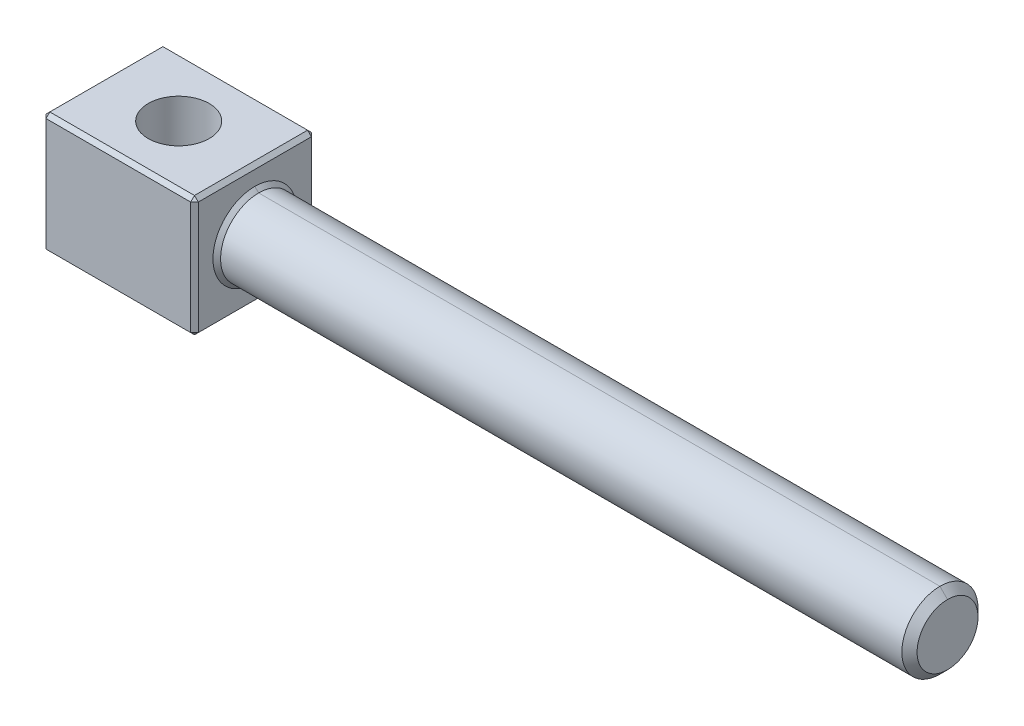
ISO-10303-21;
HEADER;
FILE_DESCRIPTION(('STEP AP214'),'2;1');
FILE_NAME('part.step','',(''),(''),'','','');
FILE_SCHEMA(('AUTOMOTIVE_DESIGN { 1 0 10303 214 1 1 1 1 }'));
ENDSEC;
DATA;
#1=APPLICATION_CONTEXT('core data for automotive mechanical design processes');
#2=APPLICATION_PROTOCOL_DEFINITION('international standard','automotive_design',2000,#1);
#3=PRODUCT_CONTEXT('',#1,'mechanical');
#4=PRODUCT('Part','Part','',(#3));
#5=PRODUCT_RELATED_PRODUCT_CATEGORY('part','',(#4));
#6=PRODUCT_DEFINITION_FORMATION('','',#4);
#7=PRODUCT_DEFINITION_CONTEXT('part definition',#1,'design');
#8=PRODUCT_DEFINITION('design','',#6,#7);
#9=PRODUCT_DEFINITION_SHAPE('','',#8);
#10=(LENGTH_UNIT() NAMED_UNIT(*) SI_UNIT(.MILLI.,.METRE.));
#11=(NAMED_UNIT(*) PLANE_ANGLE_UNIT() SI_UNIT($,.RADIAN.));
#12=(NAMED_UNIT(*) SI_UNIT($,.STERADIAN.) SOLID_ANGLE_UNIT());
#13=UNCERTAINTY_MEASURE_WITH_UNIT(LENGTH_MEASURE(1.E-05),#10,'distance_accuracy_value','');
#14=(GEOMETRIC_REPRESENTATION_CONTEXT(3) GLOBAL_UNCERTAINTY_ASSIGNED_CONTEXT((#13)) GLOBAL_UNIT_ASSIGNED_CONTEXT((#10,
#11,#12)) REPRESENTATION_CONTEXT('',''));
#15=CARTESIAN_POINT('',(0.,0.,0.));
#16=DIRECTION('',(0.,0.,1.));
#17=DIRECTION('',(1.,0.,0.));
#18=AXIS2_PLACEMENT_3D('',#15,#16,#17);
#19=CARTESIAN_POINT('',(10.5,0.,0.));
#20=DIRECTION('',(-1.,0.,0.));
#21=DIRECTION('',(0.,-1.,0.));
#22=AXIS2_PLACEMENT_3D('',#19,#20,#21);
#23=CONICAL_SURFACE('',#22,5.,0.785398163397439);
#24=CARTESIAN_POINT('',(10.5,0.,0.));
#25=DIRECTION('',(1.,0.,0.));
#26=DIRECTION('',(0.,1.,0.));
#27=AXIS2_PLACEMENT_3D('',#24,#25,#26);
#28=CIRCLE('',#27,5.);
#29=CARTESIAN_POINT('',(10.5,5.,0.));
#30=VERTEX_POINT('',#29);
#31=CARTESIAN_POINT('',(10.5,-5.,0.));
#32=VERTEX_POINT('',#31);
#33=EDGE_CURVE('E288',#30,#32,#28,.T.);
#34=ORIENTED_EDGE('',*,*,#33,.F.);
#35=DIRECTION('',(-0.707106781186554,0.707106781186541,0.));
#36=VECTOR('',#35,1.);
#37=CARTESIAN_POINT('',(10.5,5.,0.));
#38=LINE('',#37,#36);
#39=CARTESIAN_POINT('',(10.,5.5,0.));
#40=VERTEX_POINT('',#39);
#41=EDGE_CURVE('E9',#30,#40,#38,.T.);
#42=ORIENTED_EDGE('',*,*,#41,.T.);
#43=CARTESIAN_POINT('',(10.,0.,0.));
#44=DIRECTION('',(-1.,0.,0.));
#45=DIRECTION('',(0.,1.,0.));
#46=AXIS2_PLACEMENT_3D('',#43,#44,#45);
#47=CIRCLE('',#46,5.5);
#48=CARTESIAN_POINT('',(10.,-5.5,0.));
#49=VERTEX_POINT('',#48);
#50=EDGE_CURVE('E308',#49,#40,#47,.T.);
#51=ORIENTED_EDGE('',*,*,#50,.F.);
#52=DIRECTION('',(-0.707106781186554,-0.707106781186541,0.));
#53=VECTOR('',#52,1.);
#54=CARTESIAN_POINT('',(10.5,-5.,0.));
#55=LINE('',#54,#53);
#56=EDGE_CURVE('E246',#32,#49,#55,.T.);
#57=ORIENTED_EDGE('',*,*,#56,.F.);
#58=EDGE_LOOP('',(#34,#42,#51,#57));
#59=FACE_BOUND('',#58,.T.);
#60=ADVANCED_FACE('F14',(#59),#23,.T.);
#61=CARTESIAN_POINT('',(100.96,0.,0.));
#62=DIRECTION('',(-1.,0.,0.));
#63=DIRECTION('',(0.,-1.,0.));
#64=AXIS2_PLACEMENT_3D('',#61,#62,#63);
#65=CONICAL_SURFACE('',#64,4.,0.785398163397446);
#66=CARTESIAN_POINT('',(100.96,0.,0.));
#67=DIRECTION('',(1.,0.,0.));
#68=DIRECTION('',(0.,1.,0.));
#69=AXIS2_PLACEMENT_3D('',#66,#67,#68);
#70=CIRCLE('',#69,4.);
#71=CARTESIAN_POINT('',(100.96,4.,0.));
#72=VERTEX_POINT('',#71);
#73=CARTESIAN_POINT('',(100.96,-4.,0.));
#74=VERTEX_POINT('',#73);
#75=EDGE_CURVE('E272',#72,#74,#70,.T.);
#76=ORIENTED_EDGE('',*,*,#75,.F.);
#77=DIRECTION('',(-0.707106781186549,0.707106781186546,0.));
#78=VECTOR('',#77,1.);
#79=CARTESIAN_POINT('',(100.96,4.,0.));
#80=LINE('',#79,#78);
#81=CARTESIAN_POINT('',(99.96,5.,0.));
#82=VERTEX_POINT('',#81);
#83=EDGE_CURVE('E25',#72,#82,#80,.T.);
#84=ORIENTED_EDGE('',*,*,#83,.T.);
#85=CARTESIAN_POINT('',(99.96,0.,0.));
#86=DIRECTION('',(-1.,0.,0.));
#87=DIRECTION('',(0.,1.,0.));
#88=AXIS2_PLACEMENT_3D('',#85,#86,#87);
#89=CIRCLE('',#88,5.);
#90=CARTESIAN_POINT('',(99.96,-5.,0.));
#91=VERTEX_POINT('',#90);
#92=EDGE_CURVE('E239',#91,#82,#89,.T.);
#93=ORIENTED_EDGE('',*,*,#92,.F.);
#94=DIRECTION('',(-0.707106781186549,-0.707106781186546,0.));
#95=VECTOR('',#94,1.);
#96=CARTESIAN_POINT('',(100.96,-4.,0.));
#97=LINE('',#96,#95);
#98=EDGE_CURVE('E130',#74,#91,#97,.T.);
#99=ORIENTED_EDGE('',*,*,#98,.F.);
#100=EDGE_LOOP('',(#76,#84,#93,#99));
#101=FACE_BOUND('',#100,.T.);
#102=ADVANCED_FACE('F442',(#101),#65,.T.);
#103=CARTESIAN_POINT('',(100.96,0.,0.));
#104=DIRECTION('',(-1.,0.,0.));
#105=DIRECTION('',(0.,-1.,0.));
#106=AXIS2_PLACEMENT_3D('',#103,#104,#105);
#107=CYLINDRICAL_SURFACE('',#106,5.);
#108=ORIENTED_EDGE('',*,*,#92,.T.);
#109=DIRECTION('',(-1.,0.,0.));
#110=VECTOR('',#109,1.);
#111=CARTESIAN_POINT('',(100.96,5.,0.));
#112=LINE('',#111,#110);
#113=EDGE_CURVE('E225',#82,#30,#112,.T.);
#114=ORIENTED_EDGE('',*,*,#113,.T.);
#115=ORIENTED_EDGE('',*,*,#33,.T.);
#116=DIRECTION('',(-1.,0.,0.));
#117=VECTOR('',#116,1.);
#118=CARTESIAN_POINT('',(100.96,-5.,0.));
#119=LINE('',#118,#117);
#120=EDGE_CURVE('E318',#91,#32,#119,.T.);
#121=ORIENTED_EDGE('',*,*,#120,.F.);
#122=EDGE_LOOP('',(#108,#114,#115,#121));
#123=FACE_BOUND('',#122,.T.);
#124=ADVANCED_FACE('F429',(#123),#107,.T.);
#125=CARTESIAN_POINT('',(10.,-7.925,7.925));
#126=DIRECTION('',(0.,1.,0.));
#127=DIRECTION('',(-1.,0.,0.));
#128=AXIS2_PLACEMENT_3D('',#125,#126,#127);
#129=PLANE('',#128);
#130=DIRECTION('',(1.,0.,0.));
#131=VECTOR('',#130,1.);
#132=CARTESIAN_POINT('',(10.,-7.925,-7.425));
#133=LINE('',#132,#131);
#134=CARTESIAN_POINT('',(-9.5,-7.925,-7.425));
#135=VERTEX_POINT('',#134);
#136=CARTESIAN_POINT('',(9.5,-7.925,-7.425));
#137=VERTEX_POINT('',#136);
#138=EDGE_CURVE('E292',#135,#137,#133,.T.);
#139=ORIENTED_EDGE('',*,*,#138,.T.);
#140=DIRECTION('',(0.,0.,1.));
#141=VECTOR('',#140,1.);
#142=CARTESIAN_POINT('',(9.5,-7.925,7.925));
#143=LINE('',#142,#141);
#144=CARTESIAN_POINT('',(9.5,-7.925,7.425));
#145=VERTEX_POINT('',#144);
#146=EDGE_CURVE('E375',#137,#145,#143,.T.);
#147=ORIENTED_EDGE('',*,*,#146,.T.);
#148=DIRECTION('',(-1.,0.,0.));
#149=VECTOR('',#148,1.);
#150=CARTESIAN_POINT('',(10.,-7.925,7.425));
#151=LINE('',#150,#149);
#152=CARTESIAN_POINT('',(-9.5,-7.925,7.425));
#153=VERTEX_POINT('',#152);
#154=EDGE_CURVE('E295',#145,#153,#151,.T.);
#155=ORIENTED_EDGE('',*,*,#154,.T.);
#156=DIRECTION('',(0.,0.,-1.));
#157=VECTOR('',#156,1.);
#158=CARTESIAN_POINT('',(-9.5,-7.925,7.925));
#159=LINE('',#158,#157);
#160=EDGE_CURVE('E266',#153,#135,#159,.T.);
#161=ORIENTED_EDGE('',*,*,#160,.T.);
#162=EDGE_LOOP('',(#139,#147,#155,#161));
#163=FACE_BOUND('',#162,.T.);
#164=CARTESIAN_POINT('',(0.,-7.925,0.));
#165=DIRECTION('',(0.,-1.,0.));
#166=DIRECTION('',(1.,0.,0.));
#167=AXIS2_PLACEMENT_3D('',#164,#165,#166);
#168=CIRCLE('',#167,4.);
#169=CARTESIAN_POINT('',(4.,-7.925,0.));
#170=VERTEX_POINT('',#169);
#171=EDGE_CURVE('E595',#170,#170,#168,.T.);
#172=ORIENTED_EDGE('',*,*,#171,.F.);
#173=EDGE_LOOP('',(#172));
#174=FACE_BOUND('',#173,.T.);
#175=ADVANCED_FACE('F538',(#163,#174),#129,.F.);
#176=CARTESIAN_POINT('',(10.,-7.925,-7.925));
#177=DIRECTION('',(0.,0.,1.));
#178=DIRECTION('',(1.,0.,0.));
#179=AXIS2_PLACEMENT_3D('',#176,#177,#178);
#180=PLANE('',#179);
#181=DIRECTION('',(0.,1.,0.));
#182=VECTOR('',#181,1.);
#183=CARTESIAN_POINT('',(-9.5,-7.925,-7.925));
#184=LINE('',#183,#182);
#185=CARTESIAN_POINT('',(-9.5,-7.425,-7.925));
#186=VERTEX_POINT('',#185);
#187=CARTESIAN_POINT('',(-9.5,7.425,-7.925));
#188=VERTEX_POINT('',#187);
#189=EDGE_CURVE('E210',#186,#188,#184,.T.);
#190=ORIENTED_EDGE('',*,*,#189,.T.);
#191=DIRECTION('',(1.,0.,0.));
#192=VECTOR('',#191,1.);
#193=CARTESIAN_POINT('',(10.,7.425,-7.925));
#194=LINE('',#193,#192);
#195=CARTESIAN_POINT('',(9.5,7.425,-7.925));
#196=VERTEX_POINT('',#195);
#197=EDGE_CURVE('E267',#188,#196,#194,.T.);
#198=ORIENTED_EDGE('',*,*,#197,.T.);
#199=DIRECTION('',(0.,-1.,0.));
#200=VECTOR('',#199,1.);
#201=CARTESIAN_POINT('',(9.5,-7.925,-7.925));
#202=LINE('',#201,#200);
#203=CARTESIAN_POINT('',(9.5,-7.425,-7.925));
#204=VERTEX_POINT('',#203);
#205=EDGE_CURVE('E271',#196,#204,#202,.T.);
#206=ORIENTED_EDGE('',*,*,#205,.T.);
#207=DIRECTION('',(-1.,0.,0.));
#208=VECTOR('',#207,1.);
#209=CARTESIAN_POINT('',(10.,-7.425,-7.925));
#210=LINE('',#209,#208);
#211=EDGE_CURVE('E335',#204,#186,#210,.T.);
#212=ORIENTED_EDGE('',*,*,#211,.T.);
#213=EDGE_LOOP('',(#190,#198,#206,#212));
#214=FACE_BOUND('',#213,.T.);
#215=ADVANCED_FACE('F16',(#214),#180,.F.);
#216=CARTESIAN_POINT('',(10.,7.925,7.925));
#217=DIRECTION('',(0.,-1.,0.));
#218=DIRECTION('',(1.,0.,0.));
#219=AXIS2_PLACEMENT_3D('',#216,#217,#218);
#220=PLANE('',#219);
#221=DIRECTION('',(-1.,0.,0.));
#222=VECTOR('',#221,1.);
#223=CARTESIAN_POINT('',(10.,7.925,-7.425));
#224=LINE('',#223,#222);
#225=CARTESIAN_POINT('',(9.5,7.925,-7.425));
#226=VERTEX_POINT('',#225);
#227=CARTESIAN_POINT('',(-9.5,7.925,-7.425));
#228=VERTEX_POINT('',#227);
#229=EDGE_CURVE('E230',#226,#228,#224,.T.);
#230=ORIENTED_EDGE('',*,*,#229,.T.);
#231=DIRECTION('',(0.,0.,1.));
#232=VECTOR('',#231,1.);
#233=CARTESIAN_POINT('',(-9.5,7.925,7.925));
#234=LINE('',#233,#232);
#235=CARTESIAN_POINT('',(-9.5,7.925,7.425));
#236=VERTEX_POINT('',#235);
#237=EDGE_CURVE('E227',#228,#236,#234,.T.);
#238=ORIENTED_EDGE('',*,*,#237,.T.);
#239=DIRECTION('',(1.,0.,0.));
#240=VECTOR('',#239,1.);
#241=CARTESIAN_POINT('',(10.,7.925,7.425));
#242=LINE('',#241,#240);
#243=CARTESIAN_POINT('',(9.5,7.925,7.425));
#244=VERTEX_POINT('',#243);
#245=EDGE_CURVE('E231',#236,#244,#242,.T.);
#246=ORIENTED_EDGE('',*,*,#245,.T.);
#247=DIRECTION('',(0.,0.,-1.));
#248=VECTOR('',#247,1.);
#249=CARTESIAN_POINT('',(9.5,7.925,-7.925));
#250=LINE('',#249,#248);
#251=EDGE_CURVE('E296',#244,#226,#250,.T.);
#252=ORIENTED_EDGE('',*,*,#251,.T.);
#253=EDGE_LOOP('',(#230,#238,#246,#252));
#254=FACE_BOUND('',#253,.T.);
#255=CARTESIAN_POINT('',(0.,7.925,0.));
#256=DIRECTION('',(0.,-1.,0.));
#257=DIRECTION('',(0.,0.,-1.));
#258=AXIS2_PLACEMENT_3D('',#255,#256,#257);
#259=CIRCLE('',#258,4.);
#260=CARTESIAN_POINT('',(0.,7.925,-4.));
#261=VERTEX_POINT('',#260);
#262=EDGE_CURVE('E383',#261,#261,#259,.F.);
#263=ORIENTED_EDGE('',*,*,#262,.F.);
#264=EDGE_LOOP('',(#263));
#265=FACE_BOUND('',#264,.T.);
#266=ADVANCED_FACE('F505',(#254,#265),#220,.F.);
#267=CARTESIAN_POINT('',(10.,-7.925,7.925));
#268=DIRECTION('',(0.,0.,-1.));
#269=DIRECTION('',(0.,1.,0.));
#270=AXIS2_PLACEMENT_3D('',#267,#268,#269);
#271=PLANE('',#270);
#272=DIRECTION('',(0.,1.,0.));
#273=VECTOR('',#272,1.);
#274=CARTESIAN_POINT('',(9.5,7.925,7.925));
#275=LINE('',#274,#273);
#276=CARTESIAN_POINT('',(9.5,-7.425,7.925));
#277=VERTEX_POINT('',#276);
#278=CARTESIAN_POINT('',(9.5,7.425,7.925));
#279=VERTEX_POINT('',#278);
#280=EDGE_CURVE('E300',#277,#279,#275,.T.);
#281=ORIENTED_EDGE('',*,*,#280,.T.);
#282=DIRECTION('',(-1.,0.,0.));
#283=VECTOR('',#282,1.);
#284=CARTESIAN_POINT('',(10.,7.425,7.925));
#285=LINE('',#284,#283);
#286=CARTESIAN_POINT('',(-9.5,7.425,7.925));
#287=VERTEX_POINT('',#286);
#288=EDGE_CURVE('E255',#279,#287,#285,.T.);
#289=ORIENTED_EDGE('',*,*,#288,.T.);
#290=DIRECTION('',(0.,-1.,0.));
#291=VECTOR('',#290,1.);
#292=CARTESIAN_POINT('',(-9.5,-7.925,7.925));
#293=LINE('',#292,#291);
#294=CARTESIAN_POINT('',(-9.5,-7.425,7.925));
#295=VERTEX_POINT('',#294);
#296=EDGE_CURVE('E251',#287,#295,#293,.T.);
#297=ORIENTED_EDGE('',*,*,#296,.T.);
#298=DIRECTION('',(1.,0.,0.));
#299=VECTOR('',#298,1.);
#300=CARTESIAN_POINT('',(10.,-7.425,7.925));
#301=LINE('',#300,#299);
#302=EDGE_CURVE('E256',#295,#277,#301,.T.);
#303=ORIENTED_EDGE('',*,*,#302,.T.);
#304=EDGE_LOOP('',(#281,#289,#297,#303));
#305=FACE_BOUND('',#304,.T.);
#306=ADVANCED_FACE('F491',(#305),#271,.F.);
#307=CARTESIAN_POINT('',(10.,-0.849528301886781,0.494811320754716));
#308=DIRECTION('',(1.,0.,0.));
#309=DIRECTION('',(0.,0.,1.));
#310=AXIS2_PLACEMENT_3D('',#307,#308,#309);
#311=PLANE('',#310);
#312=DIRECTION('',(0.,1.,0.));
#313=VECTOR('',#312,1.);
#314=CARTESIAN_POINT('',(10.,7.925,-7.425));
#315=LINE('',#314,#313);
#316=CARTESIAN_POINT('',(10.,-7.425,-7.425));
#317=VERTEX_POINT('',#316);
#318=CARTESIAN_POINT('',(10.,7.425,-7.425));
#319=VERTEX_POINT('',#318);
#320=EDGE_CURVE('E283',#317,#319,#315,.T.);
#321=ORIENTED_EDGE('',*,*,#320,.T.);
#322=DIRECTION('',(0.,0.,1.));
#323=VECTOR('',#322,1.);
#324=CARTESIAN_POINT('',(10.,7.425,7.925));
#325=LINE('',#324,#323);
#326=CARTESIAN_POINT('',(10.,7.425,7.425));
#327=VERTEX_POINT('',#326);
#328=EDGE_CURVE('E279',#319,#327,#325,.T.);
#329=ORIENTED_EDGE('',*,*,#328,.T.);
#330=DIRECTION('',(0.,-1.,0.));
#331=VECTOR('',#330,1.);
#332=CARTESIAN_POINT('',(10.,-7.925,7.425));
#333=LINE('',#332,#331);
#334=CARTESIAN_POINT('',(10.,-7.425,7.425));
#335=VERTEX_POINT('',#334);
#336=EDGE_CURVE('E284',#327,#335,#333,.T.);
#337=ORIENTED_EDGE('',*,*,#336,.T.);
#338=DIRECTION('',(0.,0.,-1.));
#339=VECTOR('',#338,1.);
#340=CARTESIAN_POINT('',(10.,-7.425,-7.925));
#341=LINE('',#340,#339);
#342=EDGE_CURVE('E312',#335,#317,#341,.T.);
#343=ORIENTED_EDGE('',*,*,#342,.T.);
#344=EDGE_LOOP('',(#321,#329,#337,#343));
#345=FACE_BOUND('',#344,.T.);
#346=ORIENTED_EDGE('',*,*,#50,.T.);
#347=CARTESIAN_POINT('',(10.,0.,0.));
#348=DIRECTION('',(-1.,0.,0.));
#349=DIRECTION('',(0.,1.,0.));
#350=AXIS2_PLACEMENT_3D('',#347,#348,#349);
#351=CIRCLE('',#350,5.5);
#352=EDGE_CURVE('E313',#40,#49,#351,.T.);
#353=ORIENTED_EDGE('',*,*,#352,.T.);
#354=EDGE_LOOP('',(#346,#353));
#355=FACE_BOUND('',#354,.T.);
#356=ADVANCED_FACE('F542',(#345,#355),#311,.T.);
#357=CARTESIAN_POINT('',(-10.,-0.849528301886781,0.494811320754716));
#358=DIRECTION('',(1.,0.,0.));
#359=DIRECTION('',(0.,0.,1.));
#360=AXIS2_PLACEMENT_3D('',#357,#358,#359);
#361=PLANE('',#360);
#362=DIRECTION('',(0.,1.,0.));
#363=VECTOR('',#362,1.);
#364=CARTESIAN_POINT('',(-10.,-0.849528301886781,7.425));
#365=LINE('',#364,#363);
#366=CARTESIAN_POINT('',(-10.,-7.425,7.425));
#367=VERTEX_POINT('',#366);
#368=CARTESIAN_POINT('',(-10.,7.425,7.425));
#369=VERTEX_POINT('',#368);
#370=EDGE_CURVE('E356',#367,#369,#365,.T.);
#371=ORIENTED_EDGE('',*,*,#370,.T.);
#372=DIRECTION('',(0.,0.,-1.));
#373=VECTOR('',#372,1.);
#374=CARTESIAN_POINT('',(-10.,7.425,0.494811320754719));
#375=LINE('',#374,#373);
#376=CARTESIAN_POINT('',(-10.,7.425,-7.425));
#377=VERTEX_POINT('',#376);
#378=EDGE_CURVE('E201',#369,#377,#375,.T.);
#379=ORIENTED_EDGE('',*,*,#378,.T.);
#380=DIRECTION('',(0.,-1.,0.));
#381=VECTOR('',#380,1.);
#382=CARTESIAN_POINT('',(-10.,-0.849528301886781,-7.425));
#383=LINE('',#382,#381);
#384=CARTESIAN_POINT('',(-10.,-7.425,-7.425));
#385=VERTEX_POINT('',#384);
#386=EDGE_CURVE('E195',#377,#385,#383,.T.);
#387=ORIENTED_EDGE('',*,*,#386,.T.);
#388=DIRECTION('',(0.,0.,1.));
#389=VECTOR('',#388,1.);
#390=CARTESIAN_POINT('',(-10.,-7.425,0.494811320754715));
#391=LINE('',#390,#389);
#392=EDGE_CURVE('E18',#385,#367,#391,.T.);
#393=ORIENTED_EDGE('',*,*,#392,.T.);
#394=EDGE_LOOP('',(#371,#379,#387,#393));
#395=FACE_BOUND('',#394,.T.);
#396=ADVANCED_FACE('F199',(#395),#361,.F.);
#397=CARTESIAN_POINT('',(100.96,0.,0.));
#398=DIRECTION('',(-1.,0.,0.));
#399=DIRECTION('',(0.,-1.,0.));
#400=AXIS2_PLACEMENT_3D('',#397,#398,#399);
#401=CYLINDRICAL_SURFACE('',#400,5.);
#402=ORIENTED_EDGE('',*,*,#113,.F.);
#403=CARTESIAN_POINT('',(99.96,0.,0.));
#404=DIRECTION('',(-1.,0.,0.));
#405=DIRECTION('',(0.,1.,0.));
#406=AXIS2_PLACEMENT_3D('',#403,#404,#405);
#407=CIRCLE('',#406,5.);
#408=EDGE_CURVE('E196',#82,#91,#407,.T.);
#409=ORIENTED_EDGE('',*,*,#408,.T.);
#410=ORIENTED_EDGE('',*,*,#120,.T.);
#411=CARTESIAN_POINT('',(10.5,0.,0.));
#412=DIRECTION('',(1.,0.,0.));
#413=DIRECTION('',(0.,1.,0.));
#414=AXIS2_PLACEMENT_3D('',#411,#412,#413);
#415=CIRCLE('',#414,5.);
#416=EDGE_CURVE('E307',#32,#30,#415,.T.);
#417=ORIENTED_EDGE('',*,*,#416,.T.);
#418=EDGE_LOOP('',(#402,#409,#410,#417));
#419=FACE_BOUND('',#418,.T.);
#420=ADVANCED_FACE('F437',(#419),#401,.T.);
#421=CARTESIAN_POINT('',(100.96,0.,0.));
#422=DIRECTION('',(1.,0.,0.));
#423=DIRECTION('',(0.,0.,1.));
#424=AXIS2_PLACEMENT_3D('',#421,#422,#423);
#425=PLANE('',#424);
#426=CARTESIAN_POINT('',(100.96,0.,0.));
#427=DIRECTION('',(1.,0.,0.));
#428=DIRECTION('',(0.,1.,0.));
#429=AXIS2_PLACEMENT_3D('',#426,#427,#428);
#430=CIRCLE('',#429,4.);
#431=EDGE_CURVE('E275',#74,#72,#430,.T.);
#432=ORIENTED_EDGE('',*,*,#431,.T.);
#433=ORIENTED_EDGE('',*,*,#75,.T.);
#434=EDGE_LOOP('',(#432,#433));
#435=FACE_BOUND('',#434,.T.);
#436=ADVANCED_FACE('F446',(#435),#425,.T.);
#437=CARTESIAN_POINT('',(100.96,0.,0.));
#438=DIRECTION('',(-1.,0.,0.));
#439=DIRECTION('',(0.,-1.,0.));
#440=AXIS2_PLACEMENT_3D('',#437,#438,#439);
#441=CONICAL_SURFACE('',#440,4.,0.785398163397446);
#442=ORIENTED_EDGE('',*,*,#83,.F.);
#443=ORIENTED_EDGE('',*,*,#431,.F.);
#444=ORIENTED_EDGE('',*,*,#98,.T.);
#445=ORIENTED_EDGE('',*,*,#408,.F.);
#446=EDGE_LOOP('',(#442,#443,#444,#445));
#447=FACE_BOUND('',#446,.T.);
#448=ADVANCED_FACE('F444',(#447),#441,.T.);
#449=CARTESIAN_POINT('',(10.5,0.,0.));
#450=DIRECTION('',(-1.,0.,0.));
#451=DIRECTION('',(0.,-1.,0.));
#452=AXIS2_PLACEMENT_3D('',#449,#450,#451);
#453=CONICAL_SURFACE('',#452,5.,0.785398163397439);
#454=ORIENTED_EDGE('',*,*,#41,.F.);
#455=ORIENTED_EDGE('',*,*,#416,.F.);
#456=ORIENTED_EDGE('',*,*,#56,.T.);
#457=ORIENTED_EDGE('',*,*,#352,.F.);
#458=EDGE_LOOP('',(#454,#455,#456,#457));
#459=FACE_BOUND('',#458,.T.);
#460=ADVANCED_FACE('F434',(#459),#453,.T.);
#461=CARTESIAN_POINT('',(10.,-7.425,0.494811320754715));
#462=DIRECTION('',(0.707106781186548,-0.707106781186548,0.));
#463=DIRECTION('',(0.,0.,-1.));
#464=AXIS2_PLACEMENT_3D('',#461,#462,#463);
#465=PLANE('',#464);
#466=DIRECTION('',(-0.707106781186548,-0.707106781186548,0.));
#467=VECTOR('',#466,1.);
#468=CARTESIAN_POINT('',(9.75,-7.675,-7.425));
#469=LINE('',#468,#467);
#470=EDGE_CURVE('E250',#317,#137,#469,.T.);
#471=ORIENTED_EDGE('',*,*,#470,.F.);
#472=ORIENTED_EDGE('',*,*,#342,.F.);
#473=DIRECTION('',(0.707106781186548,0.707106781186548,0.));
#474=VECTOR('',#473,1.);
#475=CARTESIAN_POINT('',(9.5,-7.925,7.425));
#476=LINE('',#475,#474);
#477=EDGE_CURVE('E278',#145,#335,#476,.T.);
#478=ORIENTED_EDGE('',*,*,#477,.F.);
#479=ORIENTED_EDGE('',*,*,#146,.F.);
#480=EDGE_LOOP('',(#471,#472,#478,#479));
#481=FACE_BOUND('',#480,.T.);
#482=ADVANCED_FACE('F454',(#481),#465,.T.);
#483=CARTESIAN_POINT('',(9.5,-7.425,-7.925));
#484=DIRECTION('',(0.577350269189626,-0.577350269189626,-0.577350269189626));
#485=DIRECTION('',(0.,0.707106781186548,-0.707106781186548));
#486=AXIS2_PLACEMENT_3D('',#483,#484,#485);
#487=PLANE('',#486);
#488=DIRECTION('',(-0.707106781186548,0.,-0.707106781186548));
#489=VECTOR('',#488,1.);
#490=CARTESIAN_POINT('',(9.5,-7.425,-7.925));
#491=LINE('',#490,#489);
#492=EDGE_CURVE('E232',#317,#204,#491,.T.);
#493=ORIENTED_EDGE('',*,*,#492,.F.);
#494=ORIENTED_EDGE('',*,*,#470,.T.);
#495=DIRECTION('',(0.,-0.707106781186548,0.707106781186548));
#496=VECTOR('',#495,1.);
#497=CARTESIAN_POINT('',(9.5,-7.425,-7.925));
#498=LINE('',#497,#496);
#499=EDGE_CURVE('E234',#204,#137,#498,.T.);
#500=ORIENTED_EDGE('',*,*,#499,.F.);
#501=EDGE_LOOP('',(#493,#494,#500));
#502=FACE_BOUND('',#501,.T.);
#503=ADVANCED_FACE('F473',(#502),#487,.T.);
#504=CARTESIAN_POINT('',(9.5,-7.925,7.425));
#505=DIRECTION('',(0.577350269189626,-0.577350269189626,0.577350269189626));
#506=DIRECTION('',(0.,0.707106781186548,0.707106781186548));
#507=AXIS2_PLACEMENT_3D('',#504,#505,#506);
#508=PLANE('',#507);
#509=DIRECTION('',(0.,0.707106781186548,0.707106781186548));
#510=VECTOR('',#509,1.);
#511=CARTESIAN_POINT('',(9.5,-7.925,7.425));
#512=LINE('',#511,#510);
#513=EDGE_CURVE('E349',#145,#277,#512,.T.);
#514=ORIENTED_EDGE('',*,*,#513,.F.);
#515=ORIENTED_EDGE('',*,*,#477,.T.);
#516=DIRECTION('',(0.707106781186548,0.,-0.707106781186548));
#517=VECTOR('',#516,1.);
#518=CARTESIAN_POINT('',(9.75,-7.425,7.675));
#519=LINE('',#518,#517);
#520=EDGE_CURVE('E235',#277,#335,#519,.T.);
#521=ORIENTED_EDGE('',*,*,#520,.F.);
#522=EDGE_LOOP('',(#514,#515,#521));
#523=FACE_BOUND('',#522,.T.);
#524=ADVANCED_FACE('F470',(#523),#508,.T.);
#525=CARTESIAN_POINT('',(10.,-7.425,-7.925));
#526=DIRECTION('',(0.,0.707106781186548,0.707106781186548));
#527=DIRECTION('',(-1.,0.,0.));
#528=AXIS2_PLACEMENT_3D('',#525,#526,#527);
#529=PLANE('',#528);
#530=ORIENTED_EDGE('',*,*,#499,.T.);
#531=ORIENTED_EDGE('',*,*,#138,.F.);
#532=DIRECTION('',(0.,-0.707106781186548,0.707106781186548));
#533=VECTOR('',#532,1.);
#534=CARTESIAN_POINT('',(-9.5,-7.675,-7.675));
#535=LINE('',#534,#533);
#536=EDGE_CURVE('E180',#186,#135,#535,.T.);
#537=ORIENTED_EDGE('',*,*,#536,.F.);
#538=ORIENTED_EDGE('',*,*,#211,.F.);
#539=EDGE_LOOP('',(#530,#531,#537,#538));
#540=FACE_BOUND('',#539,.T.);
#541=ADVANCED_FACE('F472',(#540),#529,.F.);
#542=CARTESIAN_POINT('',(10.,-0.849528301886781,-7.425));
#543=DIRECTION('',(0.707106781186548,0.,-0.707106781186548));
#544=DIRECTION('',(0.,1.,0.));
#545=AXIS2_PLACEMENT_3D('',#542,#543,#544);
#546=PLANE('',#545);
#547=ORIENTED_EDGE('',*,*,#492,.T.);
#548=ORIENTED_EDGE('',*,*,#205,.F.);
#549=DIRECTION('',(-0.707106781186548,0.,-0.707106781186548));
#550=VECTOR('',#549,1.);
#551=CARTESIAN_POINT('',(9.5,7.425,-7.925));
#552=LINE('',#551,#550);
#553=EDGE_CURVE('E342',#319,#196,#552,.T.);
#554=ORIENTED_EDGE('',*,*,#553,.F.);
#555=ORIENTED_EDGE('',*,*,#320,.F.);
#556=EDGE_LOOP('',(#547,#548,#554,#555));
#557=FACE_BOUND('',#556,.T.);
#558=ADVANCED_FACE('F480',(#557),#546,.T.);
#559=CARTESIAN_POINT('',(10.,7.425,0.494811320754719));
#560=DIRECTION('',(0.707106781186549,0.707106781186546,0.));
#561=DIRECTION('',(0.,0.,-1.));
#562=AXIS2_PLACEMENT_3D('',#559,#560,#561);
#563=PLANE('',#562);
#564=DIRECTION('',(-0.707106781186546,0.707106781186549,0.));
#565=VECTOR('',#564,1.);
#566=CARTESIAN_POINT('',(10.,7.425,7.425));
#567=LINE('',#566,#565);
#568=EDGE_CURVE('E379',#327,#244,#567,.T.);
#569=ORIENTED_EDGE('',*,*,#568,.F.);
#570=ORIENTED_EDGE('',*,*,#328,.F.);
#571=DIRECTION('',(0.707106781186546,-0.707106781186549,0.));
#572=VECTOR('',#571,1.);
#573=CARTESIAN_POINT('',(9.75,7.675,-7.425));
#574=LINE('',#573,#572);
#575=EDGE_CURVE('E185',#226,#319,#574,.T.);
#576=ORIENTED_EDGE('',*,*,#575,.F.);
#577=ORIENTED_EDGE('',*,*,#251,.F.);
#578=EDGE_LOOP('',(#569,#570,#576,#577));
#579=FACE_BOUND('',#578,.T.);
#580=ADVANCED_FACE('F502',(#579),#563,.T.);
#581=CARTESIAN_POINT('',(10.,-0.849528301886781,7.425));
#582=DIRECTION('',(0.707106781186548,0.,0.707106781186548));
#583=DIRECTION('',(0.,1.,0.));
#584=AXIS2_PLACEMENT_3D('',#581,#582,#583);
#585=PLANE('',#584);
#586=ORIENTED_EDGE('',*,*,#520,.T.);
#587=ORIENTED_EDGE('',*,*,#336,.F.);
#588=DIRECTION('',(0.707106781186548,0.,-0.707106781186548));
#589=VECTOR('',#588,1.);
#590=CARTESIAN_POINT('',(10.,7.425,7.425));
#591=LINE('',#590,#589);
#592=EDGE_CURVE('E369',#279,#327,#591,.T.);
#593=ORIENTED_EDGE('',*,*,#592,.F.);
#594=ORIENTED_EDGE('',*,*,#280,.F.);
#595=EDGE_LOOP('',(#586,#587,#593,#594));
#596=FACE_BOUND('',#595,.T.);
#597=ADVANCED_FACE('F493',(#596),#585,.T.);
#598=CARTESIAN_POINT('',(10.,-7.925,7.425));
#599=DIRECTION('',(0.,0.707106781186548,-0.707106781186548));
#600=DIRECTION('',(0.,-0.707106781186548,-0.707106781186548));
#601=AXIS2_PLACEMENT_3D('',#598,#599,#600);
#602=PLANE('',#601);
#603=ORIENTED_EDGE('',*,*,#513,.T.);
#604=ORIENTED_EDGE('',*,*,#302,.F.);
#605=DIRECTION('',(0.,0.707106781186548,0.707106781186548));
#606=VECTOR('',#605,1.);
#607=CARTESIAN_POINT('',(-9.5,-7.675,7.675));
#608=LINE('',#607,#606);
#609=EDGE_CURVE('E73',#153,#295,#608,.T.);
#610=ORIENTED_EDGE('',*,*,#609,.F.);
#611=ORIENTED_EDGE('',*,*,#154,.F.);
#612=EDGE_LOOP('',(#603,#604,#610,#611));
#613=FACE_BOUND('',#612,.T.);
#614=ADVANCED_FACE('F469',(#613),#602,.F.);
#615=CARTESIAN_POINT('',(-9.5,-7.925,7.925));
#616=DIRECTION('',(0.707106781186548,0.707106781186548,0.));
#617=DIRECTION('',(0.,0.,-1.));
#618=AXIS2_PLACEMENT_3D('',#615,#616,#617);
#619=PLANE('',#618);
#620=DIRECTION('',(-0.707106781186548,0.707106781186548,0.));
#621=VECTOR('',#620,1.);
#622=CARTESIAN_POINT('',(-10.,-7.425,-7.425));
#623=LINE('',#622,#621);
#624=EDGE_CURVE('E174',#135,#385,#623,.T.);
#625=ORIENTED_EDGE('',*,*,#624,.F.);
#626=ORIENTED_EDGE('',*,*,#160,.F.);
#627=DIRECTION('',(0.707106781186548,-0.707106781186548,0.));
#628=VECTOR('',#627,1.);
#629=CARTESIAN_POINT('',(-10.,-7.425,7.425));
#630=LINE('',#629,#628);
#631=EDGE_CURVE('E190',#367,#153,#630,.T.);
#632=ORIENTED_EDGE('',*,*,#631,.F.);
#633=ORIENTED_EDGE('',*,*,#392,.F.);
#634=EDGE_LOOP('',(#625,#626,#632,#633));
#635=FACE_BOUND('',#634,.T.);
#636=ADVANCED_FACE('F189',(#635),#619,.F.);
#637=CARTESIAN_POINT('',(-10.,-7.425,-7.425));
#638=DIRECTION('',(-0.577350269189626,-0.577350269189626,-0.577350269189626));
#639=DIRECTION('',(-0.707106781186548,0.,0.707106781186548));
#640=AXIS2_PLACEMENT_3D('',#637,#638,#639);
#641=PLANE('',#640);
#642=ORIENTED_EDGE('',*,*,#536,.T.);
#643=ORIENTED_EDGE('',*,*,#624,.T.);
#644=DIRECTION('',(-0.707106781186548,0.,0.707106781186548));
#645=VECTOR('',#644,1.);
#646=CARTESIAN_POINT('',(-10.,-7.425,-7.425));
#647=LINE('',#646,#645);
#648=EDGE_CURVE('E178',#186,#385,#647,.T.);
#649=ORIENTED_EDGE('',*,*,#648,.F.);
#650=EDGE_LOOP('',(#642,#643,#649));
#651=FACE_BOUND('',#650,.T.);
#652=ADVANCED_FACE('F176',(#651),#641,.T.);
#653=CARTESIAN_POINT('',(9.5,7.425,-7.925));
#654=DIRECTION('',(0.577350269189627,0.577350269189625,-0.577350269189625));
#655=DIRECTION('',(0.,-0.707106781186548,-0.707106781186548));
#656=AXIS2_PLACEMENT_3D('',#653,#654,#655);
#657=PLANE('',#656);
#658=ORIENTED_EDGE('',*,*,#575,.T.);
#659=ORIENTED_EDGE('',*,*,#553,.T.);
#660=DIRECTION('',(0.,-0.707106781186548,-0.707106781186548));
#661=VECTOR('',#660,1.);
#662=CARTESIAN_POINT('',(9.5,7.425,-7.925));
#663=LINE('',#662,#661);
#664=EDGE_CURVE('E212',#226,#196,#663,.T.);
#665=ORIENTED_EDGE('',*,*,#664,.F.);
#666=EDGE_LOOP('',(#658,#659,#665));
#667=FACE_BOUND('',#666,.T.);
#668=ADVANCED_FACE('F525',(#667),#657,.T.);
#669=CARTESIAN_POINT('',(10.,7.425,7.425));
#670=DIRECTION('',(0.577350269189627,0.577350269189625,0.577350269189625));
#671=DIRECTION('',(0.,0.707106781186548,-0.707106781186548));
#672=AXIS2_PLACEMENT_3D('',#669,#670,#671);
#673=PLANE('',#672);
#674=ORIENTED_EDGE('',*,*,#592,.T.);
#675=ORIENTED_EDGE('',*,*,#568,.T.);
#676=DIRECTION('',(0.,0.707106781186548,-0.707106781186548));
#677=VECTOR('',#676,1.);
#678=CARTESIAN_POINT('',(9.5,7.675,7.675));
#679=LINE('',#678,#677);
#680=EDGE_CURVE('E221',#279,#244,#679,.T.);
#681=ORIENTED_EDGE('',*,*,#680,.F.);
#682=EDGE_LOOP('',(#674,#675,#681));
#683=FACE_BOUND('',#682,.T.);
#684=ADVANCED_FACE('F497',(#683),#673,.T.);
#685=CARTESIAN_POINT('',(-10.,-7.425,7.425));
#686=DIRECTION('',(-0.577350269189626,-0.577350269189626,0.577350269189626));
#687=DIRECTION('',(0.707106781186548,-0.707106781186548,0.));
#688=AXIS2_PLACEMENT_3D('',#685,#686,#687);
#689=PLANE('',#688);
#690=ORIENTED_EDGE('',*,*,#631,.T.);
#691=ORIENTED_EDGE('',*,*,#609,.T.);
#692=DIRECTION('',(0.707106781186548,0.,0.707106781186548));
#693=VECTOR('',#692,1.);
#694=CARTESIAN_POINT('',(-10.,-7.425,7.425));
#695=LINE('',#694,#693);
#696=EDGE_CURVE('E244',#367,#295,#695,.T.);
#697=ORIENTED_EDGE('',*,*,#696,.F.);
#698=EDGE_LOOP('',(#690,#691,#697));
#699=FACE_BOUND('',#698,.T.);
#700=ADVANCED_FACE('F516',(#699),#689,.T.);
#701=CARTESIAN_POINT('',(-9.5,-7.925,-7.925));
#702=DIRECTION('',(0.707106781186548,0.,0.707106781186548));
#703=DIRECTION('',(0.,1.,0.));
#704=AXIS2_PLACEMENT_3D('',#701,#702,#703);
#705=PLANE('',#704);
#706=ORIENTED_EDGE('',*,*,#648,.T.);
#707=ORIENTED_EDGE('',*,*,#386,.F.);
#708=DIRECTION('',(-0.707106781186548,0.,0.707106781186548));
#709=VECTOR('',#708,1.);
#710=CARTESIAN_POINT('',(-10.,7.425,-7.425));
#711=LINE('',#710,#709);
#712=EDGE_CURVE('E245',#188,#377,#711,.T.);
#713=ORIENTED_EDGE('',*,*,#712,.F.);
#714=ORIENTED_EDGE('',*,*,#189,.F.);
#715=EDGE_LOOP('',(#706,#707,#713,#714));
#716=FACE_BOUND('',#715,.T.);
#717=ADVANCED_FACE('F208',(#716),#705,.F.);
#718=CARTESIAN_POINT('',(10.,7.925,-7.425));
#719=DIRECTION('',(0.,-0.707106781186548,0.707106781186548));
#720=DIRECTION('',(1.,0.,0.));
#721=AXIS2_PLACEMENT_3D('',#718,#719,#720);
#722=PLANE('',#721);
#723=ORIENTED_EDGE('',*,*,#664,.T.);
#724=ORIENTED_EDGE('',*,*,#197,.F.);
#725=DIRECTION('',(0.,-0.707106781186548,-0.707106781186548));
#726=VECTOR('',#725,1.);
#727=CARTESIAN_POINT('',(-9.5,7.675,-7.675));
#728=LINE('',#727,#726);
#729=EDGE_CURVE('E240',#228,#188,#728,.T.);
#730=ORIENTED_EDGE('',*,*,#729,.F.);
#731=ORIENTED_EDGE('',*,*,#229,.F.);
#732=EDGE_LOOP('',(#723,#724,#730,#731));
#733=FACE_BOUND('',#732,.T.);
#734=ADVANCED_FACE('F524',(#733),#722,.F.);
#735=CARTESIAN_POINT('',(10.,7.425,7.925));
#736=DIRECTION('',(0.,-0.707106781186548,-0.707106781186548));
#737=DIRECTION('',(-1.,0.,0.));
#738=AXIS2_PLACEMENT_3D('',#735,#736,#737);
#739=PLANE('',#738);
#740=ORIENTED_EDGE('',*,*,#680,.T.);
#741=ORIENTED_EDGE('',*,*,#245,.F.);
#742=DIRECTION('',(0.,0.707106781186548,-0.707106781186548));
#743=VECTOR('',#742,1.);
#744=CARTESIAN_POINT('',(-9.5,7.925,7.425));
#745=LINE('',#744,#743);
#746=EDGE_CURVE('E60',#287,#236,#745,.T.);
#747=ORIENTED_EDGE('',*,*,#746,.F.);
#748=ORIENTED_EDGE('',*,*,#288,.F.);
#749=EDGE_LOOP('',(#740,#741,#747,#748));
#750=FACE_BOUND('',#749,.T.);
#751=ADVANCED_FACE('F496',(#750),#739,.F.);
#752=CARTESIAN_POINT('',(-9.5,-7.925,7.925));
#753=DIRECTION('',(0.707106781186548,0.,-0.707106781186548));
#754=DIRECTION('',(0.,1.,0.));
#755=AXIS2_PLACEMENT_3D('',#752,#753,#754);
#756=PLANE('',#755);
#757=ORIENTED_EDGE('',*,*,#696,.T.);
#758=ORIENTED_EDGE('',*,*,#296,.F.);
#759=DIRECTION('',(0.707106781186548,0.,0.707106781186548));
#760=VECTOR('',#759,1.);
#761=CARTESIAN_POINT('',(-9.75,7.425,7.675));
#762=LINE('',#761,#760);
#763=EDGE_CURVE('E262',#369,#287,#762,.T.);
#764=ORIENTED_EDGE('',*,*,#763,.F.);
#765=ORIENTED_EDGE('',*,*,#370,.F.);
#766=EDGE_LOOP('',(#757,#758,#764,#765));
#767=FACE_BOUND('',#766,.T.);
#768=ADVANCED_FACE('F515',(#767),#756,.F.);
#769=CARTESIAN_POINT('',(-10.,7.425,-7.425));
#770=DIRECTION('',(-0.577350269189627,0.577350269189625,-0.577350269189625));
#771=DIRECTION('',(-0.707106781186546,-0.707106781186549,0.));
#772=AXIS2_PLACEMENT_3D('',#769,#770,#771);
#773=PLANE('',#772);
#774=ORIENTED_EDGE('',*,*,#729,.T.);
#775=ORIENTED_EDGE('',*,*,#712,.T.);
#776=DIRECTION('',(-0.707106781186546,-0.707106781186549,0.));
#777=VECTOR('',#776,1.);
#778=CARTESIAN_POINT('',(-10.,7.425,-7.425));
#779=LINE('',#778,#777);
#780=EDGE_CURVE('E263',#228,#377,#779,.T.);
#781=ORIENTED_EDGE('',*,*,#780,.F.);
#782=EDGE_LOOP('',(#774,#775,#781));
#783=FACE_BOUND('',#782,.T.);
#784=ADVANCED_FACE('F533',(#783),#773,.T.);
#785=CARTESIAN_POINT('',(-9.5,7.925,7.425));
#786=DIRECTION('',(-0.577350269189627,0.577350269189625,0.577350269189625));
#787=DIRECTION('',(-0.707106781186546,-0.707106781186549,0.));
#788=AXIS2_PLACEMENT_3D('',#785,#786,#787);
#789=PLANE('',#788);
#790=ORIENTED_EDGE('',*,*,#763,.T.);
#791=ORIENTED_EDGE('',*,*,#746,.T.);
#792=DIRECTION('',(0.707106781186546,0.707106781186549,0.));
#793=VECTOR('',#792,1.);
#794=CARTESIAN_POINT('',(-9.5,7.925,7.425));
#795=LINE('',#794,#793);
#796=EDGE_CURVE('E345',#369,#236,#795,.T.);
#797=ORIENTED_EDGE('',*,*,#796,.F.);
#798=EDGE_LOOP('',(#790,#791,#797));
#799=FACE_BOUND('',#798,.T.);
#800=ADVANCED_FACE('F513',(#799),#789,.T.);
#801=CARTESIAN_POINT('',(-9.5,7.925,7.925));
#802=DIRECTION('',(0.707106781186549,-0.707106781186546,0.));
#803=DIRECTION('',(0.,0.,-1.));
#804=AXIS2_PLACEMENT_3D('',#801,#802,#803);
#805=PLANE('',#804);
#806=ORIENTED_EDGE('',*,*,#780,.T.);
#807=ORIENTED_EDGE('',*,*,#378,.F.);
#808=ORIENTED_EDGE('',*,*,#796,.T.);
#809=ORIENTED_EDGE('',*,*,#237,.F.);
#810=EDGE_LOOP('',(#806,#807,#808,#809));
#811=FACE_BOUND('',#810,.T.);
#812=ADVANCED_FACE('F511',(#811),#805,.F.);
#813=CARTESIAN_POINT('',(0.,92.075,0.));
#814=DIRECTION('',(0.,-1.,0.));
#815=DIRECTION('',(1.,0.,0.));
#816=AXIS2_PLACEMENT_3D('',#813,#814,#815);
#817=CYLINDRICAL_SURFACE('',#816,4.);
#818=DIRECTION('',(0.,-1.,0.));
#819=VECTOR('',#818,1.);
#820=CARTESIAN_POINT('',(4.,92.075,0.));
#821=LINE('',#820,#819);
#822=CARTESIAN_POINT('',(4.,7.425,0.));
#823=VERTEX_POINT('',#822);
#824=CARTESIAN_POINT('',(4.,-7.425,0.));
#825=VERTEX_POINT('',#824);
#826=EDGE_CURVE('E259',#823,#825,#821,.T.);
#827=ORIENTED_EDGE('',*,*,#826,.T.);
#828=ORIENTED_EDGE('',*,*,#826,.F.);
#829=EDGE_LOOP('',(#827,#828));
#830=FACE_BOUND('',#829,.T.);
#831=DIRECTION('',(0.,-1.,0.));
#832=VECTOR('',#831,1.);
#833=CARTESIAN_POINT('',(-4.,92.075,0.));
#834=LINE('',#833,#832);
#835=CARTESIAN_POINT('',(-4.,7.425,0.));
#836=VERTEX_POINT('',#835);
#837=CARTESIAN_POINT('',(-4.,-7.425,0.));
#838=VERTEX_POINT('',#837);
#839=EDGE_CURVE('E37',#836,#838,#834,.T.);
#840=ORIENTED_EDGE('',*,*,#839,.T.);
#841=ORIENTED_EDGE('',*,*,#839,.F.);
#842=EDGE_LOOP('',(#840,#841));
#843=FACE_BOUND('',#842,.T.);
#844=ORIENTED_EDGE('',*,*,#171,.T.);
#845=EDGE_LOOP('',(#844));
#846=FACE_BOUND('',#845,.T.);
#847=ORIENTED_EDGE('',*,*,#262,.T.);
#848=EDGE_LOOP('',(#847));
#849=FACE_BOUND('',#848,.T.);
#850=ADVANCED_FACE('F565',(#830,#843,#846,#849),#817,.F.);
#851=CLOSED_SHELL('',(#60,#102,#124,#175,#215,#266,#306,#356,#396,#420,#436,#448,#460,#482,#503,
#524,#541,#558,#580,#597,#614,#636,#652,#668,#684,#700,#717,#734,#751,#768,#784,#800,#812,#850));
#852=MANIFOLD_SOLID_BREP('B1',#851);
#853=ADVANCED_BREP_SHAPE_REPRESENTATION('',(#18,#852),#14);
#854=SHAPE_DEFINITION_REPRESENTATION(#9,#853);
ENDSEC;
END-ISO-10303-21;
